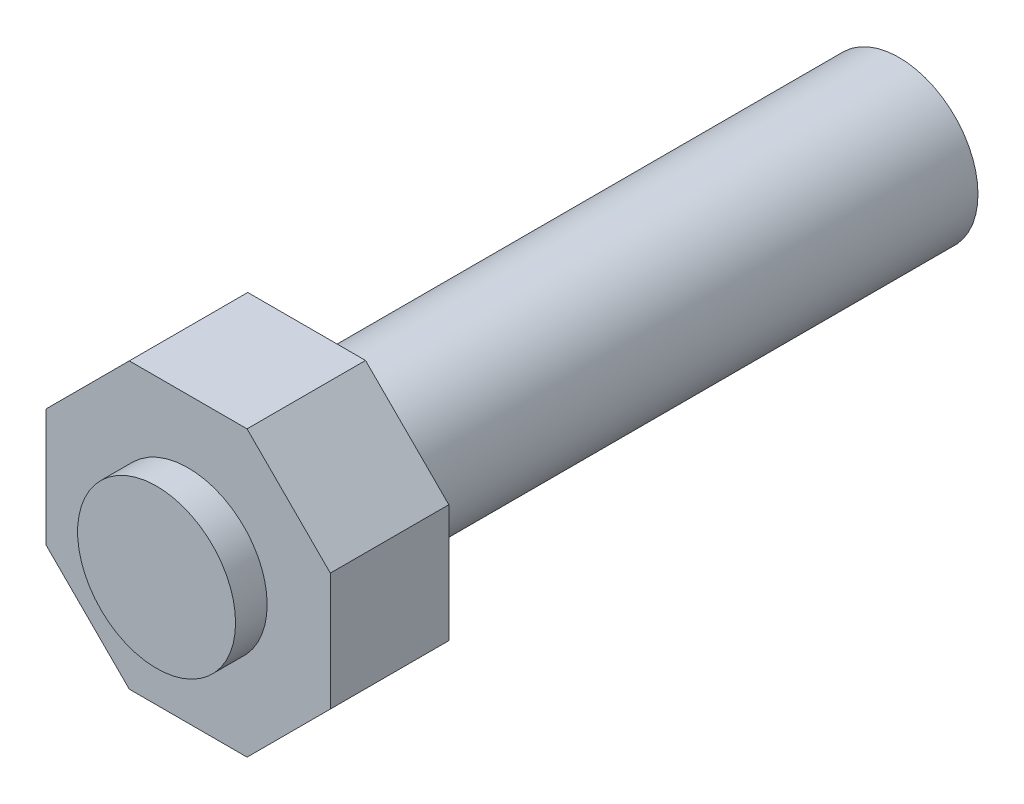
ISO-10303-21;
HEADER;
FILE_DESCRIPTION(('STEP AP214'),'2;1');
FILE_NAME('part.step','',(''),(''),'','','');
FILE_SCHEMA(('AUTOMOTIVE_DESIGN { 1 0 10303 214 1 1 1 1 }'));
ENDSEC;
DATA;
#1=APPLICATION_CONTEXT('core data for automotive mechanical design processes');
#2=APPLICATION_PROTOCOL_DEFINITION('international standard','automotive_design',2000,#1);
#3=PRODUCT_CONTEXT('',#1,'mechanical');
#4=PRODUCT('Part','Part','',(#3));
#5=PRODUCT_RELATED_PRODUCT_CATEGORY('part','',(#4));
#6=PRODUCT_DEFINITION_FORMATION('','',#4);
#7=PRODUCT_DEFINITION_CONTEXT('part definition',#1,'design');
#8=PRODUCT_DEFINITION('design','',#6,#7);
#9=PRODUCT_DEFINITION_SHAPE('','',#8);
#10=(LENGTH_UNIT() NAMED_UNIT(*) SI_UNIT(.MILLI.,.METRE.));
#11=(NAMED_UNIT(*) PLANE_ANGLE_UNIT() SI_UNIT($,.RADIAN.));
#12=(NAMED_UNIT(*) SI_UNIT($,.STERADIAN.) SOLID_ANGLE_UNIT());
#13=UNCERTAINTY_MEASURE_WITH_UNIT(LENGTH_MEASURE(1.E-05),#10,'distance_accuracy_value','');
#14=(GEOMETRIC_REPRESENTATION_CONTEXT(3) GLOBAL_UNCERTAINTY_ASSIGNED_CONTEXT((#13)) GLOBAL_UNIT_ASSIGNED_CONTEXT((#10,
#11,#12)) REPRESENTATION_CONTEXT('',''));
#15=CARTESIAN_POINT('',(0.,0.,0.));
#16=DIRECTION('',(0.,0.,1.));
#17=DIRECTION('',(1.,0.,0.));
#18=AXIS2_PLACEMENT_3D('',#15,#16,#17);
#19=CARTESIAN_POINT('',(10.,0.,75.));
#20=DIRECTION('',(0.,0.,1.));
#21=DIRECTION('',(1.,0.,0.));
#22=AXIS2_PLACEMENT_3D('',#19,#20,#21);
#23=PLANE('',#22);
#24=CARTESIAN_POINT('',(0.,0.,75.));
#25=DIRECTION('',(0.,0.,1.));
#26=DIRECTION('',(1.,0.,0.));
#27=AXIS2_PLACEMENT_3D('',#24,#25,#26);
#28=CIRCLE('',#27,10.);
#29=CARTESIAN_POINT('',(10.,0.,75.));
#30=VERTEX_POINT('',#29);
#31=EDGE_CURVE('E22',#30,#30,#28,.T.);
#32=ORIENTED_EDGE('',*,*,#31,.T.);
#33=EDGE_LOOP('',(#32));
#34=FACE_BOUND('',#33,.T.);
#35=DIRECTION('',(-0.707106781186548,-0.707106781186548,0.));
#36=VECTOR('',#35,1.);
#37=CARTESIAN_POINT('',(18.,-7.45584412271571,75.));
#38=LINE('',#37,#36);
#39=CARTESIAN_POINT('',(18.,-7.45584412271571,75.));
#40=VERTEX_POINT('',#39);
#41=CARTESIAN_POINT('',(7.45584412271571,-18.,75.));
#42=VERTEX_POINT('',#41);
#43=EDGE_CURVE('E101',#40,#42,#38,.T.);
#44=ORIENTED_EDGE('',*,*,#43,.T.);
#45=DIRECTION('',(1.,0.,0.));
#46=VECTOR('',#45,1.);
#47=CARTESIAN_POINT('',(-7.45584412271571,-18.,75.));
#48=LINE('',#47,#46);
#49=CARTESIAN_POINT('',(-7.45584412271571,-18.,75.));
#50=VERTEX_POINT('',#49);
#51=EDGE_CURVE('E99',#50,#42,#48,.T.);
#52=ORIENTED_EDGE('',*,*,#51,.F.);
#53=DIRECTION('',(0.707106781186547,-0.707106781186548,0.));
#54=VECTOR('',#53,1.);
#55=CARTESIAN_POINT('',(-18.,-7.4558441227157,75.));
#56=LINE('',#55,#54);
#57=CARTESIAN_POINT('',(-18.,-7.4558441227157,75.));
#58=VERTEX_POINT('',#57);
#59=EDGE_CURVE('E29',#58,#50,#56,.T.);
#60=ORIENTED_EDGE('',*,*,#59,.F.);
#61=DIRECTION('',(0.,-1.,0.));
#62=VECTOR('',#61,1.);
#63=CARTESIAN_POINT('',(-18.,7.45584412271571,75.));
#64=LINE('',#63,#62);
#65=CARTESIAN_POINT('',(-18.,7.45584412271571,75.));
#66=VERTEX_POINT('',#65);
#67=EDGE_CURVE('E89',#66,#58,#64,.T.);
#68=ORIENTED_EDGE('',*,*,#67,.F.);
#69=DIRECTION('',(0.707106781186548,0.707106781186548,0.));
#70=VECTOR('',#69,1.);
#71=CARTESIAN_POINT('',(-18.,7.45584412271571,75.));
#72=LINE('',#71,#70);
#73=CARTESIAN_POINT('',(-7.45584412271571,18.,75.));
#74=VERTEX_POINT('',#73);
#75=EDGE_CURVE('E94',#66,#74,#72,.T.);
#76=ORIENTED_EDGE('',*,*,#75,.T.);
#77=DIRECTION('',(1.,0.,0.));
#78=VECTOR('',#77,1.);
#79=CARTESIAN_POINT('',(-7.45584412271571,18.,75.));
#80=LINE('',#79,#78);
#81=CARTESIAN_POINT('',(7.45584412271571,18.,75.));
#82=VERTEX_POINT('',#81);
#83=EDGE_CURVE('E216',#74,#82,#80,.T.);
#84=ORIENTED_EDGE('',*,*,#83,.T.);
#85=DIRECTION('',(0.707106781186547,-0.707106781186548,0.));
#86=VECTOR('',#85,1.);
#87=CARTESIAN_POINT('',(7.45584412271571,18.,75.));
#88=LINE('',#87,#86);
#89=CARTESIAN_POINT('',(18.,7.45584412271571,75.));
#90=VERTEX_POINT('',#89);
#91=EDGE_CURVE('E214',#82,#90,#88,.T.);
#92=ORIENTED_EDGE('',*,*,#91,.T.);
#93=DIRECTION('',(0.,-1.,0.));
#94=VECTOR('',#93,1.);
#95=CARTESIAN_POINT('',(18.,7.45584412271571,75.));
#96=LINE('',#95,#94);
#97=EDGE_CURVE('E126',#90,#40,#96,.T.);
#98=ORIENTED_EDGE('',*,*,#97,.T.);
#99=EDGE_LOOP('',(#44,#52,#60,#68,#76,#84,#92,#98));
#100=FACE_BOUND('',#99,.T.);
#101=ADVANCED_FACE('F14',(#34,#100),#23,.F.);
#102=CARTESIAN_POINT('',(0.,0.,0.));
#103=DIRECTION('',(0.,0.,1.));
#104=DIRECTION('',(1.,0.,0.));
#105=AXIS2_PLACEMENT_3D('',#102,#103,#104);
#106=PLANE('',#105);
#107=CARTESIAN_POINT('',(0.,0.,0.));
#108=DIRECTION('',(0.,0.,1.));
#109=DIRECTION('',(1.,0.,0.));
#110=AXIS2_PLACEMENT_3D('',#107,#108,#109);
#111=CIRCLE('',#110,10.);
#112=CARTESIAN_POINT('',(10.,0.,0.));
#113=VERTEX_POINT('',#112);
#114=EDGE_CURVE('E9',#113,#113,#111,.T.);
#115=ORIENTED_EDGE('',*,*,#114,.F.);
#116=EDGE_LOOP('',(#115));
#117=FACE_BOUND('',#116,.T.);
#118=ADVANCED_FACE('F16',(#117),#106,.F.);
#119=CARTESIAN_POINT('',(0.,0.,80.));
#120=DIRECTION('',(0.,0.,1.));
#121=DIRECTION('',(1.,0.,0.));
#122=AXIS2_PLACEMENT_3D('',#119,#120,#121);
#123=CYLINDRICAL_SURFACE('',#122,10.);
#124=ORIENTED_EDGE('',*,*,#31,.F.);
#125=EDGE_LOOP('',(#124));
#126=FACE_BOUND('',#125,.T.);
#127=ORIENTED_EDGE('',*,*,#114,.T.);
#128=EDGE_LOOP('',(#127));
#129=FACE_BOUND('',#128,.T.);
#130=ADVANCED_FACE('F147',(#126,#129),#123,.T.);
#131=CARTESIAN_POINT('',(18.,-7.45584412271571,90.));
#132=DIRECTION('',(0.707106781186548,-0.707106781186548,0.));
#133=DIRECTION('',(0.707106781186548,0.707106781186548,0.));
#134=AXIS2_PLACEMENT_3D('',#131,#132,#133);
#135=PLANE('',#134);
#136=DIRECTION('',(0.,0.,-1.));
#137=VECTOR('',#136,1.);
#138=CARTESIAN_POINT('',(18.,-7.45584412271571,90.));
#139=LINE('',#138,#137);
#140=CARTESIAN_POINT('',(18.,-7.45584412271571,90.));
#141=VERTEX_POINT('',#140);
#142=EDGE_CURVE('E136',#141,#40,#139,.T.);
#143=ORIENTED_EDGE('',*,*,#142,.F.);
#144=DIRECTION('',(-0.707106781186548,-0.707106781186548,0.));
#145=VECTOR('',#144,1.);
#146=CARTESIAN_POINT('',(18.,-7.45584412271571,90.));
#147=LINE('',#146,#145);
#148=CARTESIAN_POINT('',(7.45584412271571,-18.,90.));
#149=VERTEX_POINT('',#148);
#150=EDGE_CURVE('E37',#141,#149,#147,.T.);
#151=ORIENTED_EDGE('',*,*,#150,.T.);
#152=DIRECTION('',(0.,0.,-1.));
#153=VECTOR('',#152,1.);
#154=CARTESIAN_POINT('',(7.45584412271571,-18.,90.));
#155=LINE('',#154,#153);
#156=EDGE_CURVE('E109',#149,#42,#155,.T.);
#157=ORIENTED_EDGE('',*,*,#156,.T.);
#158=ORIENTED_EDGE('',*,*,#43,.F.);
#159=EDGE_LOOP('',(#143,#151,#157,#158));
#160=FACE_BOUND('',#159,.T.);
#161=ADVANCED_FACE('F150',(#160),#135,.T.);
#162=CARTESIAN_POINT('',(18.,7.45584412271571,90.));
#163=DIRECTION('',(1.,0.,0.));
#164=DIRECTION('',(0.,0.,-1.));
#165=AXIS2_PLACEMENT_3D('',#162,#163,#164);
#166=PLANE('',#165);
#167=DIRECTION('',(0.,0.,-1.));
#168=VECTOR('',#167,1.);
#169=CARTESIAN_POINT('',(18.,7.45584412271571,90.));
#170=LINE('',#169,#168);
#171=CARTESIAN_POINT('',(18.,7.45584412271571,90.));
#172=VERTEX_POINT('',#171);
#173=EDGE_CURVE('E134',#172,#90,#170,.T.);
#174=ORIENTED_EDGE('',*,*,#173,.F.);
#175=DIRECTION('',(0.,-1.,0.));
#176=VECTOR('',#175,1.);
#177=CARTESIAN_POINT('',(18.,7.45584412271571,90.));
#178=LINE('',#177,#176);
#179=EDGE_CURVE('E106',#172,#141,#178,.T.);
#180=ORIENTED_EDGE('',*,*,#179,.T.);
#181=ORIENTED_EDGE('',*,*,#142,.T.);
#182=ORIENTED_EDGE('',*,*,#97,.F.);
#183=EDGE_LOOP('',(#174,#180,#181,#182));
#184=FACE_BOUND('',#183,.T.);
#185=ADVANCED_FACE('F177',(#184),#166,.T.);
#186=CARTESIAN_POINT('',(7.45584412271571,18.,90.));
#187=DIRECTION('',(0.707106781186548,0.707106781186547,0.));
#188=DIRECTION('',(-0.707106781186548,0.707106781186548,0.));
#189=AXIS2_PLACEMENT_3D('',#186,#187,#188);
#190=PLANE('',#189);
#191=DIRECTION('',(0.,0.,-1.));
#192=VECTOR('',#191,1.);
#193=CARTESIAN_POINT('',(7.45584412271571,18.,90.));
#194=LINE('',#193,#192);
#195=CARTESIAN_POINT('',(7.45584412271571,18.,90.));
#196=VERTEX_POINT('',#195);
#197=EDGE_CURVE('E132',#196,#82,#194,.T.);
#198=ORIENTED_EDGE('',*,*,#197,.F.);
#199=DIRECTION('',(0.707106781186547,-0.707106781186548,0.));
#200=VECTOR('',#199,1.);
#201=CARTESIAN_POINT('',(7.45584412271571,18.,90.));
#202=LINE('',#201,#200);
#203=EDGE_CURVE('E110',#196,#172,#202,.T.);
#204=ORIENTED_EDGE('',*,*,#203,.T.);
#205=ORIENTED_EDGE('',*,*,#173,.T.);
#206=ORIENTED_EDGE('',*,*,#91,.F.);
#207=EDGE_LOOP('',(#198,#204,#205,#206));
#208=FACE_BOUND('',#207,.T.);
#209=ADVANCED_FACE('F180',(#208),#190,.T.);
#210=CARTESIAN_POINT('',(-7.45584412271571,18.,90.));
#211=DIRECTION('',(0.,1.,0.));
#212=DIRECTION('',(-1.,0.,0.));
#213=AXIS2_PLACEMENT_3D('',#210,#211,#212);
#214=PLANE('',#213);
#215=DIRECTION('',(0.,0.,-1.));
#216=VECTOR('',#215,1.);
#217=CARTESIAN_POINT('',(-7.45584412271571,18.,90.));
#218=LINE('',#217,#216);
#219=CARTESIAN_POINT('',(-7.45584412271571,18.,90.));
#220=VERTEX_POINT('',#219);
#221=EDGE_CURVE('E130',#220,#74,#218,.T.);
#222=ORIENTED_EDGE('',*,*,#221,.F.);
#223=DIRECTION('',(1.,0.,0.));
#224=VECTOR('',#223,1.);
#225=CARTESIAN_POINT('',(-7.45584412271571,18.,90.));
#226=LINE('',#225,#224);
#227=EDGE_CURVE('E113',#220,#196,#226,.T.);
#228=ORIENTED_EDGE('',*,*,#227,.T.);
#229=ORIENTED_EDGE('',*,*,#197,.T.);
#230=ORIENTED_EDGE('',*,*,#83,.F.);
#231=EDGE_LOOP('',(#222,#228,#229,#230));
#232=FACE_BOUND('',#231,.T.);
#233=ADVANCED_FACE('F184',(#232),#214,.T.);
#234=CARTESIAN_POINT('',(-18.,7.45584412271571,90.));
#235=DIRECTION('',(-0.707106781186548,0.707106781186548,0.));
#236=DIRECTION('',(-0.707106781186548,-0.707106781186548,0.));
#237=AXIS2_PLACEMENT_3D('',#234,#235,#236);
#238=PLANE('',#237);
#239=DIRECTION('',(0.,0.,-1.));
#240=VECTOR('',#239,1.);
#241=CARTESIAN_POINT('',(-18.,7.45584412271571,90.));
#242=LINE('',#241,#240);
#243=CARTESIAN_POINT('',(-18.,7.45584412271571,90.));
#244=VERTEX_POINT('',#243);
#245=EDGE_CURVE('E85',#244,#66,#242,.T.);
#246=ORIENTED_EDGE('',*,*,#245,.F.);
#247=DIRECTION('',(0.707106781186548,0.707106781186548,0.));
#248=VECTOR('',#247,1.);
#249=CARTESIAN_POINT('',(-18.,7.45584412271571,90.));
#250=LINE('',#249,#248);
#251=EDGE_CURVE('E116',#244,#220,#250,.T.);
#252=ORIENTED_EDGE('',*,*,#251,.T.);
#253=ORIENTED_EDGE('',*,*,#221,.T.);
#254=ORIENTED_EDGE('',*,*,#75,.F.);
#255=EDGE_LOOP('',(#246,#252,#253,#254));
#256=FACE_BOUND('',#255,.T.);
#257=ADVANCED_FACE('F188',(#256),#238,.T.);
#258=CARTESIAN_POINT('',(-18.,7.45584412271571,90.));
#259=DIRECTION('',(1.,0.,0.));
#260=DIRECTION('',(0.,0.,-1.));
#261=AXIS2_PLACEMENT_3D('',#258,#259,#260);
#262=PLANE('',#261);
#263=DIRECTION('',(0.,0.,-1.));
#264=VECTOR('',#263,1.);
#265=CARTESIAN_POINT('',(-18.,-7.4558441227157,90.));
#266=LINE('',#265,#264);
#267=CARTESIAN_POINT('',(-18.,-7.4558441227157,90.));
#268=VERTEX_POINT('',#267);
#269=EDGE_CURVE('E77',#268,#58,#266,.T.);
#270=ORIENTED_EDGE('',*,*,#269,.F.);
#271=DIRECTION('',(0.,-1.,0.));
#272=VECTOR('',#271,1.);
#273=CARTESIAN_POINT('',(-18.,7.45584412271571,90.));
#274=LINE('',#273,#272);
#275=EDGE_CURVE('E119',#244,#268,#274,.T.);
#276=ORIENTED_EDGE('',*,*,#275,.F.);
#277=ORIENTED_EDGE('',*,*,#245,.T.);
#278=ORIENTED_EDGE('',*,*,#67,.T.);
#279=EDGE_LOOP('',(#270,#276,#277,#278));
#280=FACE_BOUND('',#279,.T.);
#281=ADVANCED_FACE('F90',(#280),#262,.F.);
#282=CARTESIAN_POINT('',(-18.,-7.4558441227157,90.));
#283=DIRECTION('',(0.707106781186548,0.707106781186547,0.));
#284=DIRECTION('',(-0.707106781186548,0.707106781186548,0.));
#285=AXIS2_PLACEMENT_3D('',#282,#283,#284);
#286=PLANE('',#285);
#287=DIRECTION('',(0.,0.,-1.));
#288=VECTOR('',#287,1.);
#289=CARTESIAN_POINT('',(-7.45584412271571,-18.,90.));
#290=LINE('',#289,#288);
#291=CARTESIAN_POINT('',(-7.45584412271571,-18.,90.));
#292=VERTEX_POINT('',#291);
#293=EDGE_CURVE('E86',#292,#50,#290,.T.);
#294=ORIENTED_EDGE('',*,*,#293,.F.);
#295=DIRECTION('',(0.707106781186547,-0.707106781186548,0.));
#296=VECTOR('',#295,1.);
#297=CARTESIAN_POINT('',(-18.,-7.4558441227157,90.));
#298=LINE('',#297,#296);
#299=EDGE_CURVE('E81',#268,#292,#298,.T.);
#300=ORIENTED_EDGE('',*,*,#299,.F.);
#301=ORIENTED_EDGE('',*,*,#269,.T.);
#302=ORIENTED_EDGE('',*,*,#59,.T.);
#303=EDGE_LOOP('',(#294,#300,#301,#302));
#304=FACE_BOUND('',#303,.T.);
#305=ADVANCED_FACE('F79',(#304),#286,.F.);
#306=CARTESIAN_POINT('',(-7.45584412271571,-18.,90.));
#307=DIRECTION('',(0.,1.,0.));
#308=DIRECTION('',(0.,0.,1.));
#309=AXIS2_PLACEMENT_3D('',#306,#307,#308);
#310=PLANE('',#309);
#311=DIRECTION('',(1.,0.,0.));
#312=VECTOR('',#311,1.);
#313=CARTESIAN_POINT('',(-7.45584412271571,-18.,90.));
#314=LINE('',#313,#312);
#315=EDGE_CURVE('E122',#292,#149,#314,.T.);
#316=ORIENTED_EDGE('',*,*,#315,.F.);
#317=ORIENTED_EDGE('',*,*,#293,.T.);
#318=ORIENTED_EDGE('',*,*,#51,.T.);
#319=ORIENTED_EDGE('',*,*,#156,.F.);
#320=EDGE_LOOP('',(#316,#317,#318,#319));
#321=FACE_BOUND('',#320,.T.);
#322=ADVANCED_FACE('F175',(#321),#310,.F.);
#323=CARTESIAN_POINT('',(10.,0.,94.));
#324=DIRECTION('',(0.,0.,-1.));
#325=DIRECTION('',(-1.,0.,0.));
#326=AXIS2_PLACEMENT_3D('',#323,#324,#325);
#327=PLANE('',#326);
#328=CARTESIAN_POINT('',(0.,0.,94.));
#329=DIRECTION('',(0.,0.,1.));
#330=DIRECTION('',(1.,0.,0.));
#331=AXIS2_PLACEMENT_3D('',#328,#329,#330);
#332=CIRCLE('',#331,10.);
#333=CARTESIAN_POINT('',(10.,0.,94.));
#334=VERTEX_POINT('',#333);
#335=EDGE_CURVE('E138',#334,#334,#332,.T.);
#336=ORIENTED_EDGE('',*,*,#335,.T.);
#337=EDGE_LOOP('',(#336));
#338=FACE_BOUND('',#337,.T.);
#339=ADVANCED_FACE('F171',(#338),#327,.F.);
#340=CARTESIAN_POINT('',(0.,0.,80.));
#341=DIRECTION('',(0.,0.,1.));
#342=DIRECTION('',(1.,0.,0.));
#343=AXIS2_PLACEMENT_3D('',#340,#341,#342);
#344=CYLINDRICAL_SURFACE('',#343,10.);
#345=ORIENTED_EDGE('',*,*,#335,.F.);
#346=EDGE_LOOP('',(#345));
#347=FACE_BOUND('',#346,.T.);
#348=CARTESIAN_POINT('',(0.,0.,90.));
#349=DIRECTION('',(0.,0.,1.));
#350=DIRECTION('',(1.,0.,0.));
#351=AXIS2_PLACEMENT_3D('',#348,#349,#350);
#352=CIRCLE('',#351,10.);
#353=CARTESIAN_POINT('',(10.,0.,90.));
#354=VERTEX_POINT('',#353);
#355=EDGE_CURVE('E141',#354,#354,#352,.T.);
#356=ORIENTED_EDGE('',*,*,#355,.T.);
#357=EDGE_LOOP('',(#356));
#358=FACE_BOUND('',#357,.T.);
#359=ADVANCED_FACE('F167',(#347,#358),#344,.T.);
#360=CARTESIAN_POINT('',(20.,0.,90.));
#361=DIRECTION('',(0.,0.,-1.));
#362=DIRECTION('',(-1.,0.,0.));
#363=AXIS2_PLACEMENT_3D('',#360,#361,#362);
#364=PLANE('',#363);
#365=ORIENTED_EDGE('',*,*,#355,.F.);
#366=EDGE_LOOP('',(#365));
#367=FACE_BOUND('',#366,.T.);
#368=ORIENTED_EDGE('',*,*,#150,.F.);
#369=ORIENTED_EDGE('',*,*,#179,.F.);
#370=ORIENTED_EDGE('',*,*,#203,.F.);
#371=ORIENTED_EDGE('',*,*,#227,.F.);
#372=ORIENTED_EDGE('',*,*,#251,.F.);
#373=ORIENTED_EDGE('',*,*,#275,.T.);
#374=ORIENTED_EDGE('',*,*,#299,.T.);
#375=ORIENTED_EDGE('',*,*,#315,.T.);
#376=EDGE_LOOP('',(#368,#369,#370,#371,#372,#373,#374,#375));
#377=FACE_BOUND('',#376,.T.);
#378=ADVANCED_FACE('F164',(#367,#377),#364,.F.);
#379=CLOSED_SHELL('',(#101,#118,#130,#161,#185,#209,#233,#257,#281,#305,#322,#339,#359,#378));
#380=MANIFOLD_SOLID_BREP('B1',#379);
#381=ADVANCED_BREP_SHAPE_REPRESENTATION('',(#18,#380),#14);
#382=SHAPE_DEFINITION_REPRESENTATION(#9,#381);
ENDSEC;
END-ISO-10303-21;
